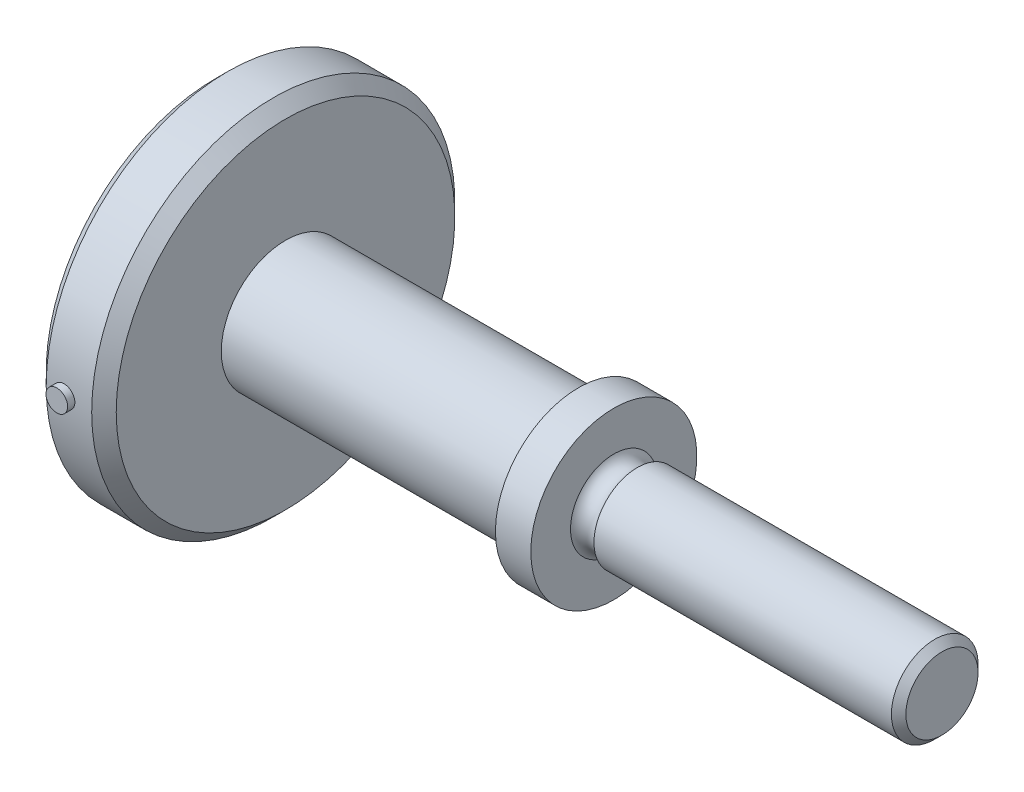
ISO-10303-21;
HEADER;
FILE_DESCRIPTION(('STEP AP214'),'2;1');
FILE_NAME('part.step','',(''),(''),'','','');
FILE_SCHEMA(('AUTOMOTIVE_DESIGN { 1 0 10303 214 1 1 1 1 }'));
ENDSEC;
DATA;
#1=APPLICATION_CONTEXT('core data for automotive mechanical design processes');
#2=APPLICATION_PROTOCOL_DEFINITION('international standard','automotive_design',2000,#1);
#3=PRODUCT_CONTEXT('',#1,'mechanical');
#4=PRODUCT('Part','Part','',(#3));
#5=PRODUCT_RELATED_PRODUCT_CATEGORY('part','',(#4));
#6=PRODUCT_DEFINITION_FORMATION('','',#4);
#7=PRODUCT_DEFINITION_CONTEXT('part definition',#1,'design');
#8=PRODUCT_DEFINITION('design','',#6,#7);
#9=PRODUCT_DEFINITION_SHAPE('','',#8);
#10=(LENGTH_UNIT() NAMED_UNIT(*) SI_UNIT(.MILLI.,.METRE.));
#11=(NAMED_UNIT(*) PLANE_ANGLE_UNIT() SI_UNIT($,.RADIAN.));
#12=(NAMED_UNIT(*) SI_UNIT($,.STERADIAN.) SOLID_ANGLE_UNIT());
#13=UNCERTAINTY_MEASURE_WITH_UNIT(LENGTH_MEASURE(1.E-05),#10,'distance_accuracy_value','');
#14=(GEOMETRIC_REPRESENTATION_CONTEXT(3) GLOBAL_UNCERTAINTY_ASSIGNED_CONTEXT((#13)) GLOBAL_UNIT_ASSIGNED_CONTEXT((#10,
#11,#12)) REPRESENTATION_CONTEXT('',''));
#15=CARTESIAN_POINT('',(0.,0.,0.));
#16=DIRECTION('',(0.,0.,1.));
#17=DIRECTION('',(1.,0.,0.));
#18=AXIS2_PLACEMENT_3D('',#15,#16,#17);
#19=CARTESIAN_POINT('',(-96.4495544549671,0.,26.15));
#20=DIRECTION('',(0.,0.,-1.));
#21=DIRECTION('',(-1.,0.,0.));
#22=AXIS2_PLACEMENT_3D('',#19,#20,#21);
#23=CYLINDRICAL_SURFACE('',#22,1.5);
#24=CARTESIAN_POINT('',(-96.4495544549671,0.,26.15));
#25=DIRECTION('',(0.,0.,1.));
#26=DIRECTION('',(1.,0.,0.));
#27=AXIS2_PLACEMENT_3D('',#24,#25,#26);
#28=CIRCLE('',#27,1.5);
#29=CARTESIAN_POINT('',(-94.9495544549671,0.,26.15));
#30=VERTEX_POINT('',#29);
#31=EDGE_CURVE('E11',#30,#30,#28,.T.);
#32=ORIENTED_EDGE('',*,*,#31,.F.);
#33=EDGE_LOOP('',(#32));
#34=FACE_BOUND('',#33,.T.);
#35=CARTESIAN_POINT('',(-96.4495544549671,0.,25.15));
#36=DIRECTION('',(0.,0.,1.));
#37=DIRECTION('',(1.,0.,0.));
#38=AXIS2_PLACEMENT_3D('',#35,#36,#37);
#39=CIRCLE('',#38,1.5);
#40=CARTESIAN_POINT('',(-94.9495544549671,0.,25.15));
#41=VERTEX_POINT('',#40);
#42=EDGE_CURVE('E45',#41,#41,#39,.T.);
#43=ORIENTED_EDGE('',*,*,#42,.T.);
#44=EDGE_LOOP('',(#43));
#45=FACE_BOUND('',#44,.T.);
#46=ADVANCED_FACE('F42',(#34,#45),#23,.T.);
#47=CARTESIAN_POINT('',(-96.4495544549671,0.,26.15));
#48=DIRECTION('',(0.,0.,1.));
#49=DIRECTION('',(1.,0.,0.));
#50=AXIS2_PLACEMENT_3D('',#47,#48,#49);
#51=PLANE('',#50);
#52=ORIENTED_EDGE('',*,*,#31,.T.);
#53=EDGE_LOOP('',(#52));
#54=FACE_BOUND('',#53,.T.);
#55=ADVANCED_FACE('F57',(#54),#51,.T.);
#56=CARTESIAN_POINT('',(-96.4495544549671,0.,25.15));
#57=DIRECTION('',(0.,0.,1.));
#58=DIRECTION('',(1.,0.,0.));
#59=AXIS2_PLACEMENT_3D('',#56,#57,#58);
#60=PLANE('',#59);
#61=ORIENTED_EDGE('',*,*,#42,.F.);
#62=EDGE_LOOP('',(#61));
#63=FACE_BOUND('',#62,.T.);
#64=ADVANCED_FACE('F55',(#63),#60,.F.);
#65=CLOSED_SHELL('',(#46,#55,#64));
#66=MANIFOLD_SOLID_BREP('B2',#65);
#67=CARTESIAN_POINT('',(-100.62,25.15,0.));
#68=DIRECTION('',(1.,0.,0.));
#69=DIRECTION('',(0.,0.,-1.));
#70=AXIS2_PLACEMENT_3D('',#67,#68,#69);
#71=PLANE('',#70);
#72=CARTESIAN_POINT('',(-100.62,0.,0.));
#73=DIRECTION('',(1.,0.,0.));
#74=DIRECTION('',(0.,0.,-1.));
#75=AXIS2_PLACEMENT_3D('',#72,#73,#74);
#76=CIRCLE('',#75,23.45);
#77=CARTESIAN_POINT('',(-100.62,0.,-23.45));
#78=VERTEX_POINT('',#77);
#79=EDGE_CURVE('E105',#78,#78,#76,.F.);
#80=ORIENTED_EDGE('',*,*,#79,.T.);
#81=EDGE_LOOP('',(#80));
#82=FACE_BOUND('',#81,.T.);
#83=ADVANCED_FACE('F82',(#82),#71,.F.);
#84=CARTESIAN_POINT('',(-100.62,0.,0.));
#85=DIRECTION('',(-1.,0.,0.));
#86=DIRECTION('',(0.,0.,1.));
#87=AXIS2_PLACEMENT_3D('',#84,#85,#86);
#88=CYLINDRICAL_SURFACE('',#87,25.15);
#89=CARTESIAN_POINT('',(-92.62,0.,0.));
#90=DIRECTION('',(-1.,0.,0.));
#91=DIRECTION('',(0.,0.,1.));
#92=AXIS2_PLACEMENT_3D('',#89,#90,#91);
#93=CIRCLE('',#92,25.15);
#94=CARTESIAN_POINT('',(-92.62,0.,25.15));
#95=VERTEX_POINT('',#94);
#96=EDGE_CURVE('E97',#95,#95,#93,.T.);
#97=CARTESIAN_POINT('',(-98.92,0.,0.));
#98=DIRECTION('',(1.,0.,0.));
#99=DIRECTION('',(0.,0.,-1.));
#100=AXIS2_PLACEMENT_3D('',#97,#98,#99);
#101=CIRCLE('',#100,25.15);
#102=CARTESIAN_POINT('',(-98.92,0.,25.15));
#103=VERTEX_POINT('',#102);
#104=EDGE_CURVE('E102',#103,#103,#101,.T.);
#105=CARTESIAN_POINT('',(-92.62,0.,25.15));
#106=CARTESIAN_POINT('',(-92.685625,0.,25.15));
#107=CARTESIAN_POINT('',(-92.75125,0.,25.15));
#108=CARTESIAN_POINT('',(-92.8825,0.,25.15));
#109=CARTESIAN_POINT('',(-92.948125,0.,25.15));
#110=CARTESIAN_POINT('',(-93.079375,0.,25.15));
#111=CARTESIAN_POINT('',(-93.145,0.,25.15));
#112=CARTESIAN_POINT('',(-93.27625,0.,25.15));
#113=CARTESIAN_POINT('',(-93.341875,0.,25.15));
#114=CARTESIAN_POINT('',(-93.473125,0.,25.15));
#115=CARTESIAN_POINT('',(-93.53875,0.,25.15));
#116=CARTESIAN_POINT('',(-93.67,0.,25.15));
#117=CARTESIAN_POINT('',(-93.735625,0.,25.15));
#118=CARTESIAN_POINT('',(-93.866875,0.,25.15));
#119=CARTESIAN_POINT('',(-93.9325,0.,25.15));
#120=CARTESIAN_POINT('',(-94.06375,0.,25.15));
#121=CARTESIAN_POINT('',(-94.129375,0.,25.15));
#122=CARTESIAN_POINT('',(-94.260625,0.,25.15));
#123=CARTESIAN_POINT('',(-94.32625,0.,25.15));
#124=CARTESIAN_POINT('',(-94.4575,0.,25.15));
#125=CARTESIAN_POINT('',(-94.523125,0.,25.15));
#126=CARTESIAN_POINT('',(-94.654375,0.,25.15));
#127=CARTESIAN_POINT('',(-94.72,0.,25.15));
#128=CARTESIAN_POINT('',(-94.85125,0.,25.15));
#129=CARTESIAN_POINT('',(-94.916875,0.,25.15));
#130=CARTESIAN_POINT('',(-95.048125,0.,25.15));
#131=CARTESIAN_POINT('',(-95.11375,0.,25.15));
#132=CARTESIAN_POINT('',(-95.245,0.,25.15));
#133=CARTESIAN_POINT('',(-95.310625,0.,25.15));
#134=CARTESIAN_POINT('',(-95.441875,0.,25.15));
#135=CARTESIAN_POINT('',(-95.5075,0.,25.15));
#136=CARTESIAN_POINT('',(-95.63875,0.,25.15));
#137=CARTESIAN_POINT('',(-95.704375,0.,25.15));
#138=CARTESIAN_POINT('',(-95.835625,0.,25.15));
#139=CARTESIAN_POINT('',(-95.90125,0.,25.15));
#140=CARTESIAN_POINT('',(-96.0325,0.,25.15));
#141=CARTESIAN_POINT('',(-96.098125,0.,25.15));
#142=CARTESIAN_POINT('',(-96.229375,0.,25.15));
#143=CARTESIAN_POINT('',(-96.295,0.,25.15));
#144=CARTESIAN_POINT('',(-96.42625,0.,25.15));
#145=CARTESIAN_POINT('',(-96.491875,0.,25.15));
#146=CARTESIAN_POINT('',(-96.623125,0.,25.15));
#147=CARTESIAN_POINT('',(-96.68875,0.,25.15));
#148=CARTESIAN_POINT('',(-96.82,0.,25.15));
#149=CARTESIAN_POINT('',(-96.885625,0.,25.15));
#150=CARTESIAN_POINT('',(-97.016875,0.,25.15));
#151=CARTESIAN_POINT('',(-97.0825,0.,25.15));
#152=CARTESIAN_POINT('',(-97.21375,0.,25.15));
#153=CARTESIAN_POINT('',(-97.279375,0.,25.15));
#154=CARTESIAN_POINT('',(-97.410625,0.,25.15));
#155=CARTESIAN_POINT('',(-97.47625,0.,25.15));
#156=CARTESIAN_POINT('',(-97.6075,0.,25.15));
#157=CARTESIAN_POINT('',(-97.673125,0.,25.15));
#158=CARTESIAN_POINT('',(-97.804375,0.,25.15));
#159=CARTESIAN_POINT('',(-97.87,0.,25.15));
#160=CARTESIAN_POINT('',(-98.00125,0.,25.15));
#161=CARTESIAN_POINT('',(-98.066875,0.,25.15));
#162=CARTESIAN_POINT('',(-98.198125,0.,25.15));
#163=CARTESIAN_POINT('',(-98.26375,0.,25.15));
#164=CARTESIAN_POINT('',(-98.395,0.,25.15));
#165=CARTESIAN_POINT('',(-98.460625,0.,25.15));
#166=CARTESIAN_POINT('',(-98.591875,0.,25.15));
#167=CARTESIAN_POINT('',(-98.6575,0.,25.15));
#168=CARTESIAN_POINT('',(-98.78875,0.,25.15));
#169=CARTESIAN_POINT('',(-98.854375,0.,25.15));
#170=CARTESIAN_POINT('',(-98.92,0.,25.15));
#171=B_SPLINE_CURVE_WITH_KNOTS('',3,(#105,#106,#107,#108,#109,#110,#111,#112,#113,#114,#115,
#116,#117,#118,#119,#120,#121,#122,#123,#124,#125,#126,#127,#128,#129,#130,#131,#132,#133,#134,
#135,#136,#137,#138,#139,#140,#141,#142,#143,#144,#145,#146,#147,#148,#149,#150,#151,#152,#153,
#154,#155,#156,#157,#158,#159,#160,#161,#162,#163,#164,#165,#166,#167,#168,#169,#170),
.UNSPECIFIED.,.F.,.F.,(4,2,2,2,2,2,2,2,2,2,2,2,2,2,2,2,2,2,2,2,2,2,2,2,2,2,2,2,2,2,2,2,4),(0.,
0.196874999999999,0.393749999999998,0.590624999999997,0.787499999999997,0.984374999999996,
1.18124999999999,1.37812499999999,1.57499999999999,1.77187499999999,1.96874999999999,
2.16562499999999,2.36249999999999,2.55937499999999,2.75624999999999,2.95312499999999,
3.14999999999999,3.346875,3.54375,3.740625,3.9375,4.134375,4.33124999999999,4.52812499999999,
4.72499999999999,4.92187499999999,5.11874999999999,5.31562499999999,5.51249999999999,
5.70937499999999,5.90624999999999,6.10312499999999,6.3),.UNSPECIFIED.);
#172=EDGE_CURVE('BSEAM143',#95,#103,#171,.T.);
#173=ORIENTED_EDGE('',*,*,#96,.T.);
#174=ORIENTED_EDGE('',*,*,#104,.T.);
#175=ORIENTED_EDGE('',*,*,#172,.T.);
#176=ORIENTED_EDGE('',*,*,#172,.F.);
#177=EDGE_LOOP('',(#173,#175,#174,#176));
#178=FACE_BOUND('',#177,.T.);
#179=ADVANCED_FACE('F143',(#178),#88,.T.);
#180=CARTESIAN_POINT('',(-90.92,25.15,0.));
#181=DIRECTION('',(-1.,0.,0.));
#182=DIRECTION('',(0.,0.,1.));
#183=AXIS2_PLACEMENT_3D('',#180,#181,#182);
#184=PLANE('',#183);
#185=CARTESIAN_POINT('',(-90.92,0.,0.));
#186=DIRECTION('',(-1.,0.,0.));
#187=DIRECTION('',(0.,0.,1.));
#188=AXIS2_PLACEMENT_3D('',#185,#186,#187);
#189=CIRCLE('',#188,23.45);
#190=CARTESIAN_POINT('',(-90.92,0.,23.45));
#191=VERTEX_POINT('',#190);
#192=EDGE_CURVE('E93',#191,#191,#189,.F.);
#193=ORIENTED_EDGE('',*,*,#192,.T.);
#194=EDGE_LOOP('',(#193));
#195=FACE_BOUND('',#194,.T.);
#196=CARTESIAN_POINT('',(-90.92,0.,0.));
#197=DIRECTION('',(-1.,0.,0.));
#198=DIRECTION('',(0.,0.,1.));
#199=AXIS2_PLACEMENT_3D('',#196,#197,#198);
#200=CIRCLE('',#199,8.9);
#201=CARTESIAN_POINT('',(-90.92,0.,8.9));
#202=VERTEX_POINT('',#201);
#203=EDGE_CURVE('E108',#202,#202,#200,.T.);
#204=ORIENTED_EDGE('',*,*,#203,.T.);
#205=EDGE_LOOP('',(#204));
#206=FACE_BOUND('',#205,.T.);
#207=ADVANCED_FACE('F149',(#195,#206),#184,.F.);
#208=CARTESIAN_POINT('',(-100.62,0.,0.));
#209=DIRECTION('',(-1.,0.,0.));
#210=DIRECTION('',(0.,0.,1.));
#211=AXIS2_PLACEMENT_3D('',#208,#209,#210);
#212=CYLINDRICAL_SURFACE('',#211,8.9);
#213=ORIENTED_EDGE('',*,*,#203,.F.);
#214=EDGE_LOOP('',(#213));
#215=FACE_BOUND('',#214,.T.);
#216=CARTESIAN_POINT('',(-50.35,0.,0.));
#217=DIRECTION('',(-1.,0.,0.));
#218=DIRECTION('',(0.,0.,1.));
#219=AXIS2_PLACEMENT_3D('',#216,#217,#218);
#220=CIRCLE('',#219,8.9);
#221=CARTESIAN_POINT('',(-50.35,0.,8.9));
#222=VERTEX_POINT('',#221);
#223=EDGE_CURVE('E111',#222,#222,#220,.T.);
#224=ORIENTED_EDGE('',*,*,#223,.T.);
#225=EDGE_LOOP('',(#224));
#226=FACE_BOUND('',#225,.T.);
#227=ADVANCED_FACE('F173',(#215,#226),#212,.T.);
#228=CARTESIAN_POINT('',(-50.35,8.9,0.));
#229=DIRECTION('',(1.,0.,0.));
#230=DIRECTION('',(0.,0.,-1.));
#231=AXIS2_PLACEMENT_3D('',#228,#229,#230);
#232=PLANE('',#231);
#233=ORIENTED_EDGE('',*,*,#223,.F.);
#234=EDGE_LOOP('',(#233));
#235=FACE_BOUND('',#234,.T.);
#236=CARTESIAN_POINT('',(-50.35,0.,0.));
#237=DIRECTION('',(-1.,0.,0.));
#238=DIRECTION('',(0.,0.,1.));
#239=AXIS2_PLACEMENT_3D('',#236,#237,#238);
#240=CIRCLE('',#239,11.5);
#241=CARTESIAN_POINT('',(-50.35,0.,11.5));
#242=VERTEX_POINT('',#241);
#243=EDGE_CURVE('E114',#242,#242,#240,.T.);
#244=ORIENTED_EDGE('',*,*,#243,.T.);
#245=EDGE_LOOP('',(#244));
#246=FACE_BOUND('',#245,.T.);
#247=ADVANCED_FACE('F178',(#235,#246),#232,.F.);
#248=CARTESIAN_POINT('',(-100.62,0.,0.));
#249=DIRECTION('',(-1.,0.,0.));
#250=DIRECTION('',(0.,0.,1.));
#251=AXIS2_PLACEMENT_3D('',#248,#249,#250);
#252=CYLINDRICAL_SURFACE('',#251,11.5);
#253=ORIENTED_EDGE('',*,*,#243,.F.);
#254=EDGE_LOOP('',(#253));
#255=FACE_BOUND('',#254,.T.);
#256=CARTESIAN_POINT('',(-45.45,0.,0.));
#257=DIRECTION('',(-1.,0.,0.));
#258=DIRECTION('',(0.,0.,1.));
#259=AXIS2_PLACEMENT_3D('',#256,#257,#258);
#260=CIRCLE('',#259,11.5);
#261=CARTESIAN_POINT('',(-45.45,0.,11.5));
#262=VERTEX_POINT('',#261);
#263=EDGE_CURVE('E117',#262,#262,#260,.T.);
#264=ORIENTED_EDGE('',*,*,#263,.T.);
#265=EDGE_LOOP('',(#264));
#266=FACE_BOUND('',#265,.T.);
#267=ADVANCED_FACE('F184',(#255,#266),#252,.T.);
#268=CARTESIAN_POINT('',(-45.45,5.99999999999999,0.));
#269=DIRECTION('',(-1.,0.,0.));
#270=DIRECTION('',(0.,0.,1.));
#271=AXIS2_PLACEMENT_3D('',#268,#269,#270);
#272=PLANE('',#271);
#273=ORIENTED_EDGE('',*,*,#263,.F.);
#274=EDGE_LOOP('',(#273));
#275=FACE_BOUND('',#274,.T.);
#276=CARTESIAN_POINT('',(-45.45,0.,0.));
#277=DIRECTION('',(-1.,0.,0.));
#278=DIRECTION('',(0.,0.,1.));
#279=AXIS2_PLACEMENT_3D('',#276,#277,#278);
#280=CIRCLE('',#279,5.99999999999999);
#281=CARTESIAN_POINT('',(-45.45,0.,5.99999999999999));
#282=VERTEX_POINT('',#281);
#283=EDGE_CURVE('E120',#282,#282,#280,.T.);
#284=ORIENTED_EDGE('',*,*,#283,.T.);
#285=EDGE_LOOP('',(#284));
#286=FACE_BOUND('',#285,.T.);
#287=ADVANCED_FACE('F139',(#275,#286),#272,.F.);
#288=CARTESIAN_POINT('',(-43.825,0.,0.));
#289=DIRECTION('',(-1.,0.,0.));
#290=DIRECTION('',(0.,0.,1.));
#291=AXIS2_PLACEMENT_3D('',#288,#289,#290);
#292=TOROIDAL_SURFACE('',#291,6.77419312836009,1.8);
#293=ORIENTED_EDGE('',*,*,#283,.F.);
#294=EDGE_LOOP('',(#293));
#295=FACE_BOUND('',#294,.T.);
#296=CARTESIAN_POINT('',(-42.2,0.,0.));
#297=DIRECTION('',(-1.,0.,0.));
#298=DIRECTION('',(0.,0.,1.));
#299=AXIS2_PLACEMENT_3D('',#296,#297,#298);
#300=CIRCLE('',#299,5.99999999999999);
#301=CARTESIAN_POINT('',(-42.2,0.,5.99999999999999));
#302=VERTEX_POINT('',#301);
#303=EDGE_CURVE('E123',#302,#302,#300,.T.);
#304=ORIENTED_EDGE('',*,*,#303,.T.);
#305=EDGE_LOOP('',(#304));
#306=FACE_BOUND('',#305,.T.);
#307=ADVANCED_FACE('F127',(#295,#306),#292,.F.);
#308=CARTESIAN_POINT('',(-100.62,0.,0.));
#309=DIRECTION('',(-1.,0.,0.));
#310=DIRECTION('',(0.,0.,1.));
#311=AXIS2_PLACEMENT_3D('',#308,#309,#310);
#312=CYLINDRICAL_SURFACE('',#311,6.);
#313=CARTESIAN_POINT('',(-0.999999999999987,0.,0.));
#314=DIRECTION('',(-1.,0.,0.));
#315=DIRECTION('',(0.,0.,1.));
#316=AXIS2_PLACEMENT_3D('',#313,#314,#315);
#317=CIRCLE('',#316,6.);
#318=CARTESIAN_POINT('',(-0.999999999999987,0.,6.));
#319=VERTEX_POINT('',#318);
#320=EDGE_CURVE('E89',#319,#319,#317,.T.);
#321=ORIENTED_EDGE('',*,*,#320,.T.);
#322=EDGE_LOOP('',(#321));
#323=FACE_BOUND('',#322,.T.);
#324=ORIENTED_EDGE('',*,*,#303,.F.);
#325=EDGE_LOOP('',(#324));
#326=FACE_BOUND('',#325,.T.);
#327=ADVANCED_FACE('F129',(#323,#326),#312,.T.);
#328=CARTESIAN_POINT('',(0.,0.,0.));
#329=DIRECTION('',(-1.,0.,0.));
#330=DIRECTION('',(0.,0.,1.));
#331=AXIS2_PLACEMENT_3D('',#328,#329,#330);
#332=PLANE('',#331);
#333=CARTESIAN_POINT('',(0.,0.,0.));
#334=DIRECTION('',(-1.,0.,0.));
#335=DIRECTION('',(0.,0.,1.));
#336=AXIS2_PLACEMENT_3D('',#333,#334,#335);
#337=CIRCLE('',#336,5.00000000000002);
#338=CARTESIAN_POINT('',(0.,0.,5.00000000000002));
#339=VERTEX_POINT('',#338);
#340=EDGE_CURVE('E41',#339,#339,#337,.F.);
#341=ORIENTED_EDGE('',*,*,#340,.T.);
#342=EDGE_LOOP('',(#341));
#343=FACE_BOUND('',#342,.T.);
#344=ADVANCED_FACE('F131',(#343),#332,.F.);
#345=CARTESIAN_POINT('',(-100.62,0.,0.));
#346=DIRECTION('',(1.,0.,0.));
#347=DIRECTION('',(0.,0.,-1.));
#348=AXIS2_PLACEMENT_3D('',#345,#346,#347);
#349=CONICAL_SURFACE('',#348,23.45,0.785398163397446);
#350=ORIENTED_EDGE('',*,*,#104,.F.);
#351=EDGE_LOOP('',(#350));
#352=FACE_BOUND('',#351,.T.);
#353=ORIENTED_EDGE('',*,*,#79,.F.);
#354=EDGE_LOOP('',(#353));
#355=FACE_BOUND('',#354,.T.);
#356=ADVANCED_FACE('F137',(#352,#355),#349,.T.);
#357=CARTESIAN_POINT('',(-92.62,0.,0.));
#358=DIRECTION('',(-1.,0.,0.));
#359=DIRECTION('',(0.,0.,1.));
#360=AXIS2_PLACEMENT_3D('',#357,#358,#359);
#361=CONICAL_SURFACE('',#360,25.15,0.78539816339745);
#362=CARTESIAN_POINT('',(-90.92,0.,23.45));
#363=CARTESIAN_POINT('',(-90.9377083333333,0.,23.4677083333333));
#364=CARTESIAN_POINT('',(-90.9554166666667,0.,23.4854166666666));
#365=CARTESIAN_POINT('',(-90.9908333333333,0.,23.5208333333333));
#366=CARTESIAN_POINT('',(-91.0085416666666,0.,23.5385416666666));
#367=CARTESIAN_POINT('',(-91.0439583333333,0.,23.5739583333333));
#368=CARTESIAN_POINT('',(-91.0616666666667,0.,23.5916666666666));
#369=CARTESIAN_POINT('',(-91.0970833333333,0.,23.6270833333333));
#370=CARTESIAN_POINT('',(-91.1147916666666,0.,23.6447916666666));
#371=CARTESIAN_POINT('',(-91.1502083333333,0.,23.6802083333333));
#372=CARTESIAN_POINT('',(-91.1679166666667,0.,23.6979166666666));
#373=CARTESIAN_POINT('',(-91.2033333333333,0.,23.7333333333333));
#374=CARTESIAN_POINT('',(-91.2210416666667,0.,23.7510416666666));
#375=CARTESIAN_POINT('',(-91.2564583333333,0.,23.7864583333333));
#376=CARTESIAN_POINT('',(-91.2741666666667,0.,23.8041666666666));
#377=CARTESIAN_POINT('',(-91.3095833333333,0.,23.8395833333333));
#378=CARTESIAN_POINT('',(-91.3272916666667,0.,23.8572916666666));
#379=CARTESIAN_POINT('',(-91.3627083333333,0.,23.8927083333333));
#380=CARTESIAN_POINT('',(-91.3804166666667,0.,23.9104166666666));
#381=CARTESIAN_POINT('',(-91.4158333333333,0.,23.9458333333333));
#382=CARTESIAN_POINT('',(-91.4335416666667,0.,23.9635416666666));
#383=CARTESIAN_POINT('',(-91.4689583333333,0.,23.9989583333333));
#384=CARTESIAN_POINT('',(-91.4866666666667,0.,24.0166666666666));
#385=CARTESIAN_POINT('',(-91.5220833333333,0.,24.0520833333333));
#386=CARTESIAN_POINT('',(-91.5397916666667,0.,24.0697916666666));
#387=CARTESIAN_POINT('',(-91.5752083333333,0.,24.1052083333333));
#388=CARTESIAN_POINT('',(-91.5929166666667,0.,24.1229166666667));
#389=CARTESIAN_POINT('',(-91.6283333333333,0.,24.1583333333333));
#390=CARTESIAN_POINT('',(-91.6460416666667,0.,24.1760416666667));
#391=CARTESIAN_POINT('',(-91.6814583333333,0.,24.2114583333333));
#392=CARTESIAN_POINT('',(-91.6991666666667,0.,24.2291666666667));
#393=CARTESIAN_POINT('',(-91.7345833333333,0.,24.2645833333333));
#394=CARTESIAN_POINT('',(-91.7522916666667,0.,24.2822916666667));
#395=CARTESIAN_POINT('',(-91.7877083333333,0.,24.3177083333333));
#396=CARTESIAN_POINT('',(-91.8054166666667,0.,24.3354166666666));
#397=CARTESIAN_POINT('',(-91.8408333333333,0.,24.3708333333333));
#398=CARTESIAN_POINT('',(-91.8585416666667,0.,24.3885416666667));
#399=CARTESIAN_POINT('',(-91.8939583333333,0.,24.4239583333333));
#400=CARTESIAN_POINT('',(-91.9116666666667,0.,24.4416666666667));
#401=CARTESIAN_POINT('',(-91.9470833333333,0.,24.4770833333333));
#402=CARTESIAN_POINT('',(-91.9647916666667,0.,24.4947916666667));
#403=CARTESIAN_POINT('',(-92.0002083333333,0.,24.5302083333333));
#404=CARTESIAN_POINT('',(-92.0179166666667,0.,24.5479166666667));
#405=CARTESIAN_POINT('',(-92.0533333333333,0.,24.5833333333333));
#406=CARTESIAN_POINT('',(-92.0710416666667,0.,24.6010416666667));
#407=CARTESIAN_POINT('',(-92.1064583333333,0.,24.6364583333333));
#408=CARTESIAN_POINT('',(-92.1241666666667,0.,24.6541666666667));
#409=CARTESIAN_POINT('',(-92.1595833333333,0.,24.6895833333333));
#410=CARTESIAN_POINT('',(-92.1772916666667,0.,24.7072916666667));
#411=CARTESIAN_POINT('',(-92.2127083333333,0.,24.7427083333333));
#412=CARTESIAN_POINT('',(-92.2304166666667,0.,24.7604166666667));
#413=CARTESIAN_POINT('',(-92.2658333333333,0.,24.7958333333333));
#414=CARTESIAN_POINT('',(-92.2835416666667,0.,24.8135416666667));
#415=CARTESIAN_POINT('',(-92.3189583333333,0.,24.8489583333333));
#416=CARTESIAN_POINT('',(-92.3366666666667,0.,24.8666666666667));
#417=CARTESIAN_POINT('',(-92.3720833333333,0.,24.9020833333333));
#418=CARTESIAN_POINT('',(-92.3897916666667,0.,24.9197916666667));
#419=CARTESIAN_POINT('',(-92.4252083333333,0.,24.9552083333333));
#420=CARTESIAN_POINT('',(-92.4429166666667,0.,24.9729166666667));
#421=CARTESIAN_POINT('',(-92.4783333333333,0.,25.0083333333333));
#422=CARTESIAN_POINT('',(-92.4960416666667,0.,25.0260416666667));
#423=CARTESIAN_POINT('',(-92.5314583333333,0.,25.0614583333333));
#424=CARTESIAN_POINT('',(-92.5491666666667,0.,25.0791666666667));
#425=CARTESIAN_POINT('',(-92.5845833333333,0.,25.1145833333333));
#426=CARTESIAN_POINT('',(-92.6022916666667,0.,25.1322916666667));
#427=CARTESIAN_POINT('',(-92.62,0.,25.15));
#428=B_SPLINE_CURVE_WITH_KNOTS('',3,(#362,#363,#364,#365,#366,#367,#368,#369,#370,#371,#372,
#373,#374,#375,#376,#377,#378,#379,#380,#381,#382,#383,#384,#385,#386,#387,#388,#389,#390,#391,
#392,#393,#394,#395,#396,#397,#398,#399,#400,#401,#402,#403,#404,#405,#406,#407,#408,#409,#410,
#411,#412,#413,#414,#415,#416,#417,#418,#419,#420,#421,#422,#423,#424,#425,#426,#427),
.UNSPECIFIED.,.F.,.F.,(4,2,2,2,2,2,2,2,2,2,2,2,2,2,2,2,2,2,2,2,2,2,2,2,2,2,2,2,2,2,2,2,4),(0.,
0.0751300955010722,0.150260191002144,0.225390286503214,0.300520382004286,0.375650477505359,
0.450780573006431,0.525910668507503,0.601040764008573,0.676170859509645,0.751300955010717,
0.826431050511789,0.901561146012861,0.976691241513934,1.051821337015,1.12695143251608,
1.20208152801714,1.27721162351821,1.35234171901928,1.42747181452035,1.50260191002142,
1.5777320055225,1.65286210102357,1.72799219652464,1.80312229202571,1.87825238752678,
1.95338248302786,2.02851257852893,2.10364267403,2.17877276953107,2.25390286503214,
2.32903296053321,2.40416305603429),.UNSPECIFIED.);
#429=EDGE_CURVE('BSEAM155',#191,#95,#428,.T.);
#430=ORIENTED_EDGE('',*,*,#192,.F.);
#431=ORIENTED_EDGE('',*,*,#96,.F.);
#432=ORIENTED_EDGE('',*,*,#429,.T.);
#433=ORIENTED_EDGE('',*,*,#429,.F.);
#434=EDGE_LOOP('',(#430,#432,#431,#433));
#435=FACE_BOUND('',#434,.T.);
#436=ADVANCED_FACE('F155',(#435),#361,.T.);
#437=CARTESIAN_POINT('',(-0.999999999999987,0.,0.));
#438=DIRECTION('',(-1.,0.,0.));
#439=DIRECTION('',(0.,0.,1.));
#440=AXIS2_PLACEMENT_3D('',#437,#438,#439);
#441=CONICAL_SURFACE('',#440,6.,0.785398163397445);
#442=ORIENTED_EDGE('',*,*,#340,.F.);
#443=EDGE_LOOP('',(#442));
#444=FACE_BOUND('',#443,.T.);
#445=ORIENTED_EDGE('',*,*,#320,.F.);
#446=EDGE_LOOP('',(#445));
#447=FACE_BOUND('',#446,.T.);
#448=ADVANCED_FACE('F84',(#444,#447),#441,.T.);
#449=CLOSED_SHELL('',(#83,#179,#207,#227,#247,#267,#287,#307,#327,#344,#356,#436,#448));
#450=MANIFOLD_SOLID_BREP('B6',#449);
#451=ADVANCED_BREP_SHAPE_REPRESENTATION('',(#18,#66,#450),#14);
#452=SHAPE_DEFINITION_REPRESENTATION(#9,#451);
ENDSEC;
END-ISO-10303-21;
